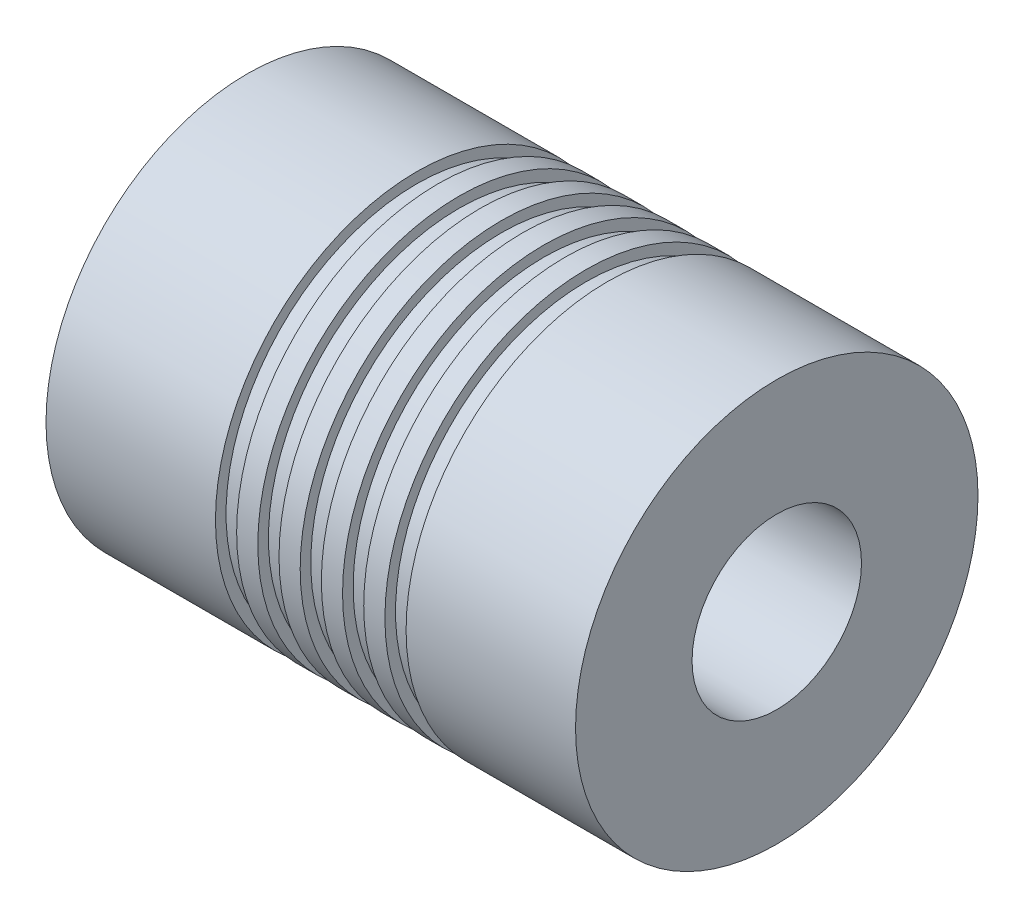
from build123d import *


with BuildPart() as part:
    # Skizze1 → Rotation1 (revolve)
    with BuildSketch(Plane.XY, mode=Mode.PRIVATE) as rotation1_sk:
        Polygon((-12.5, 2.5), (-12.5, 9.5), (-4.5, 9.5), (-4.5, 9), (-3.5, 9), (-3.5, 9.5), (-2.5, 9.5), (-2.5, 9), (-1.5, 9), (-1.5, 9.5), (-0.5, 9.5), (-0.5, 9), (0.5, 9), (0.5, 9.5), (1.5, 9.5), (1.5, 9), (2.5, 9), (2.5, 9.5), (3.5, 9.5), (3.5, 9), (4.5, 9), (4.5, 9.5), (12.5, 9.5), (12.5, 4), (0, 4), (0, 2.5), align=None)
    revolve(rotation1_sk.sketch.rotate(Axis((-12.5, 0, 0), (1, 0, 0)), 180), axis=Axis((-12.5, 0, 0), (1, 0, 0)))


solid = part.part
